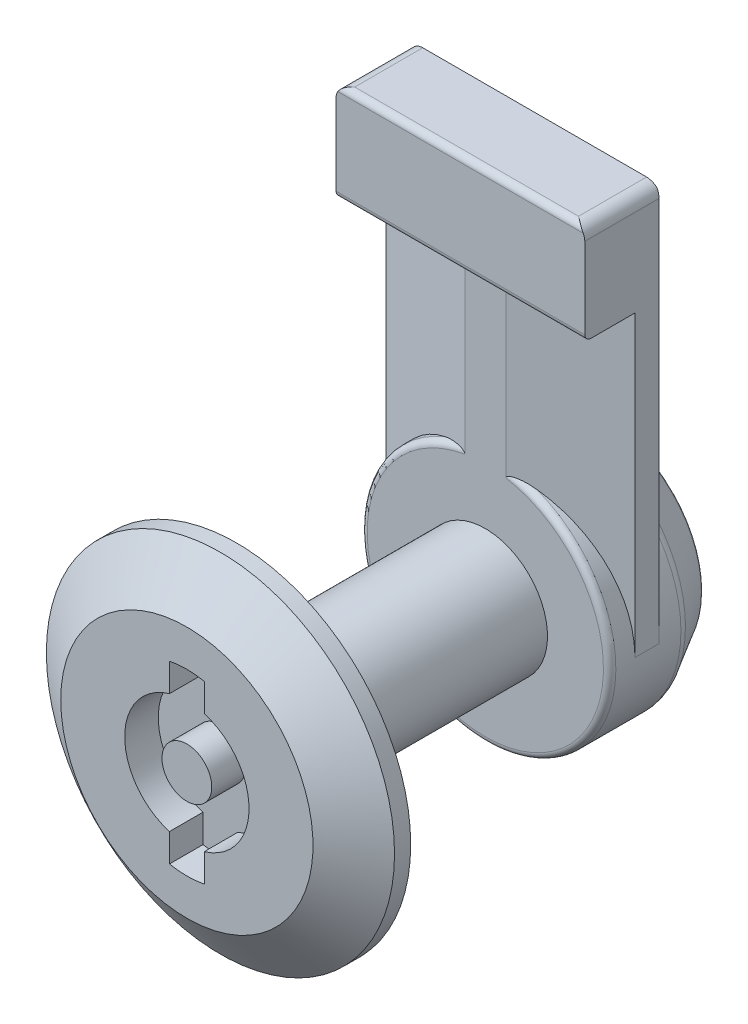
ISO-10303-21;
HEADER;
FILE_DESCRIPTION(('STEP AP214'),'2;1');
FILE_NAME('part.step','',(''),(''),'','','');
FILE_SCHEMA(('AUTOMOTIVE_DESIGN { 1 0 10303 214 1 1 1 1 }'));
ENDSEC;
DATA;
#1=APPLICATION_CONTEXT('core data for automotive mechanical design processes');
#2=APPLICATION_PROTOCOL_DEFINITION('international standard','automotive_design',2000,#1);
#3=PRODUCT_CONTEXT('',#1,'mechanical');
#4=PRODUCT('Part','Part','',(#3));
#5=PRODUCT_RELATED_PRODUCT_CATEGORY('part','',(#4));
#6=PRODUCT_DEFINITION_FORMATION('','',#4);
#7=PRODUCT_DEFINITION_CONTEXT('part definition',#1,'design');
#8=PRODUCT_DEFINITION('design','',#6,#7);
#9=PRODUCT_DEFINITION_SHAPE('','',#8);
#10=(LENGTH_UNIT() NAMED_UNIT(*) SI_UNIT(.MILLI.,.METRE.));
#11=(NAMED_UNIT(*) PLANE_ANGLE_UNIT() SI_UNIT($,.RADIAN.));
#12=(NAMED_UNIT(*) SI_UNIT($,.STERADIAN.) SOLID_ANGLE_UNIT());
#13=UNCERTAINTY_MEASURE_WITH_UNIT(LENGTH_MEASURE(1.E-05),#10,'distance_accuracy_value','');
#14=(GEOMETRIC_REPRESENTATION_CONTEXT(3) GLOBAL_UNCERTAINTY_ASSIGNED_CONTEXT((#13)) GLOBAL_UNIT_ASSIGNED_CONTEXT((#10,
#11,#12)) REPRESENTATION_CONTEXT('',''));
#15=CARTESIAN_POINT('',(0.,0.,0.));
#16=DIRECTION('',(0.,0.,1.));
#17=DIRECTION('',(1.,0.,0.));
#18=AXIS2_PLACEMENT_3D('',#15,#16,#17);
#19=CARTESIAN_POINT('',(0.,10.1440003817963,4.));
#20=DIRECTION('',(0.,0.,-1.));
#21=DIRECTION('',(-1.,0.,0.));
#22=AXIS2_PLACEMENT_3D('',#19,#20,#21);
#23=PLANE('',#22);
#24=CARTESIAN_POINT('',(0.,0.,4.));
#25=DIRECTION('',(0.,0.,-1.));
#26=DIRECTION('',(-1.,0.,0.));
#27=AXIS2_PLACEMENT_3D('',#24,#25,#26);
#28=CIRCLE('',#27,2.);
#29=CARTESIAN_POINT('',(-2.,0.,4.));
#30=VERTEX_POINT('',#29);
#31=EDGE_CURVE('E17',#30,#30,#28,.T.);
#32=ORIENTED_EDGE('',*,*,#31,.F.);
#33=EDGE_LOOP('',(#32));
#34=FACE_BOUND('',#33,.T.);
#35=ADVANCED_FACE('F14',(#34),#23,.F.);
#36=CARTESIAN_POINT('',(0.,0.,1.3));
#37=DIRECTION('',(0.,0.,-1.));
#38=DIRECTION('',(-1.,0.,0.));
#39=AXIS2_PLACEMENT_3D('',#36,#37,#38);
#40=CYLINDRICAL_SURFACE('',#39,2.);
#41=ORIENTED_EDGE('',*,*,#31,.T.);
#42=EDGE_LOOP('',(#41));
#43=FACE_BOUND('',#42,.T.);
#44=CARTESIAN_POINT('',(0.,0.,1.3));
#45=DIRECTION('',(0.,0.,-1.));
#46=DIRECTION('',(-1.,0.,0.));
#47=AXIS2_PLACEMENT_3D('',#44,#45,#46);
#48=CIRCLE('',#47,2.);
#49=CARTESIAN_POINT('',(-2.,0.,1.3));
#50=VERTEX_POINT('',#49);
#51=EDGE_CURVE('E485',#50,#50,#48,.T.);
#52=ORIENTED_EDGE('',*,*,#51,.F.);
#53=EDGE_LOOP('',(#52));
#54=FACE_BOUND('',#53,.T.);
#55=ADVANCED_FACE('F493',(#43,#54),#40,.T.);
#56=CARTESIAN_POINT('',(0.,0.,-29.5));
#57=DIRECTION('',(0.,0.,1.));
#58=DIRECTION('',(1.,0.,0.));
#59=AXIS2_PLACEMENT_3D('',#56,#57,#58);
#60=PLANE('',#59);
#61=CARTESIAN_POINT('',(0.,0.,-29.5));
#62=DIRECTION('',(0.,0.,1.));
#63=DIRECTION('',(1.,0.,0.));
#64=AXIS2_PLACEMENT_3D('',#61,#62,#63);
#65=CIRCLE('',#64,7.6905989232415);
#66=CARTESIAN_POINT('',(7.6905989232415,0.,-29.5));
#67=VERTEX_POINT('',#66);
#68=EDGE_CURVE('E198',#67,#67,#65,.T.);
#69=ORIENTED_EDGE('',*,*,#68,.F.);
#70=EDGE_LOOP('',(#69));
#71=FACE_BOUND('',#70,.T.);
#72=ADVANCED_FACE('F501',(#71),#60,.F.);
#73=CARTESIAN_POINT('',(0.,0.,1.3));
#74=DIRECTION('',(0.,0.,1.));
#75=DIRECTION('',(1.,0.,0.));
#76=AXIS2_PLACEMENT_3D('',#73,#74,#75);
#77=PLANE('',#76);
#78=DIRECTION('',(0.,1.,0.));
#79=VECTOR('',#78,1.);
#80=CARTESIAN_POINT('',(1.4,4.8,1.3));
#81=LINE('',#80,#79);
#82=CARTESIAN_POINT('',(1.4,4.8,1.3));
#83=VERTEX_POINT('',#82);
#84=CARTESIAN_POINT('',(1.4,7.06257743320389,1.3));
#85=VERTEX_POINT('',#84);
#86=EDGE_CURVE('E471',#83,#85,#81,.T.);
#87=ORIENTED_EDGE('',*,*,#86,.T.);
#88=CARTESIAN_POINT('',(0.,0.,1.3));
#89=DIRECTION('',(0.,0.,-1.));
#90=DIRECTION('',(-1.,0.,0.));
#91=AXIS2_PLACEMENT_3D('',#88,#89,#90);
#92=CIRCLE('',#91,7.2);
#93=CARTESIAN_POINT('',(-1.4,7.06257743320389,1.3));
#94=VERTEX_POINT('',#93);
#95=EDGE_CURVE('E468',#85,#94,#92,.F.);
#96=ORIENTED_EDGE('',*,*,#95,.T.);
#97=DIRECTION('',(0.,1.,0.));
#98=VECTOR('',#97,1.);
#99=CARTESIAN_POINT('',(-1.4,7.06257743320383,1.3));
#100=LINE('',#99,#98);
#101=CARTESIAN_POINT('',(-1.4,4.8,1.3));
#102=VERTEX_POINT('',#101);
#103=EDGE_CURVE('E484',#94,#102,#100,.F.);
#104=ORIENTED_EDGE('',*,*,#103,.T.);
#105=CARTESIAN_POINT('',(0.,0.,1.3));
#106=DIRECTION('',(0.,0.,-1.));
#107=DIRECTION('',(-1.,0.,0.));
#108=AXIS2_PLACEMENT_3D('',#105,#106,#107);
#109=CIRCLE('',#108,5.);
#110=CARTESIAN_POINT('',(-1.4,-4.8,1.3));
#111=VERTEX_POINT('',#110);
#112=EDGE_CURVE('E480',#102,#111,#109,.F.);
#113=ORIENTED_EDGE('',*,*,#112,.T.);
#114=DIRECTION('',(0.,1.,0.));
#115=VECTOR('',#114,1.);
#116=CARTESIAN_POINT('',(-1.4,-4.8,1.3));
#117=LINE('',#116,#115);
#118=CARTESIAN_POINT('',(-1.4,-7.06257743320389,1.3));
#119=VERTEX_POINT('',#118);
#120=EDGE_CURVE('E548',#111,#119,#117,.F.);
#121=ORIENTED_EDGE('',*,*,#120,.T.);
#122=CARTESIAN_POINT('',(0.,0.,1.3));
#123=DIRECTION('',(0.,0.,-1.));
#124=DIRECTION('',(-1.,0.,0.));
#125=AXIS2_PLACEMENT_3D('',#122,#123,#124);
#126=CIRCLE('',#125,7.2);
#127=CARTESIAN_POINT('',(1.4,-7.06257743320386,1.3));
#128=VERTEX_POINT('',#127);
#129=EDGE_CURVE('E476',#119,#128,#126,.F.);
#130=ORIENTED_EDGE('',*,*,#129,.T.);
#131=DIRECTION('',(0.,1.,0.));
#132=VECTOR('',#131,1.);
#133=CARTESIAN_POINT('',(1.4,-7.06257743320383,1.3));
#134=LINE('',#133,#132);
#135=CARTESIAN_POINT('',(1.4,-4.8,1.3));
#136=VERTEX_POINT('',#135);
#137=EDGE_CURVE('E547',#128,#136,#134,.T.);
#138=ORIENTED_EDGE('',*,*,#137,.T.);
#139=CARTESIAN_POINT('',(0.,0.,1.3));
#140=DIRECTION('',(0.,0.,-1.));
#141=DIRECTION('',(-1.,0.,0.));
#142=AXIS2_PLACEMENT_3D('',#139,#140,#141);
#143=CIRCLE('',#142,5.);
#144=EDGE_CURVE('E472',#136,#83,#143,.F.);
#145=ORIENTED_EDGE('',*,*,#144,.T.);
#146=EDGE_LOOP('',(#87,#96,#104,#113,#121,#130,#138,#145));
#147=FACE_BOUND('',#146,.T.);
#148=ORIENTED_EDGE('',*,*,#51,.T.);
#149=EDGE_LOOP('',(#148));
#150=FACE_BOUND('',#149,.T.);
#151=ADVANCED_FACE('F506',(#147,#150),#77,.T.);
#152=CARTESIAN_POINT('',(0.,0.,-29.));
#153=DIRECTION('',(0.,0.,1.));
#154=DIRECTION('',(1.,0.,0.));
#155=AXIS2_PLACEMENT_3D('',#152,#153,#154);
#156=TOROIDAL_SURFACE('',#155,7.6905989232,0.5);
#157=CARTESIAN_POINT('',(0.,0.,-29.2499999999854));
#158=DIRECTION('',(0.,0.,1.));
#159=DIRECTION('',(1.,0.,0.));
#160=AXIS2_PLACEMENT_3D('',#157,#158,#159);
#161=CIRCLE('',#160,8.12361162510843);
#162=CARTESIAN_POINT('',(8.12361162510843,0.,-29.2499999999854));
#163=VERTEX_POINT('',#162);
#164=EDGE_CURVE('E467',#163,#163,#161,.T.);
#165=ORIENTED_EDGE('',*,*,#164,.F.);
#166=EDGE_LOOP('',(#165));
#167=FACE_BOUND('',#166,.T.);
#168=ORIENTED_EDGE('',*,*,#68,.T.);
#169=EDGE_LOOP('',(#168));
#170=FACE_BOUND('',#169,.T.);
#171=ADVANCED_FACE('F529',(#167,#170),#156,.T.);
#172=CARTESIAN_POINT('',(-10.,32.,-23.97));
#173=DIRECTION('',(0.,0.,1.));
#174=DIRECTION('',(1.,0.,0.));
#175=AXIS2_PLACEMENT_3D('',#172,#173,#174);
#176=PLANE('',#175);
#177=DIRECTION('',(-1.,0.,0.));
#178=VECTOR('',#177,1.);
#179=CARTESIAN_POINT('',(0.,32.,-23.97));
#180=LINE('',#179,#178);
#181=CARTESIAN_POINT('',(9.,32.,-23.97));
#182=VERTEX_POINT('',#181);
#183=CARTESIAN_POINT('',(-9.,32.,-23.97));
#184=VERTEX_POINT('',#183);
#185=EDGE_CURVE('E201',#182,#184,#180,.T.);
#186=ORIENTED_EDGE('',*,*,#185,.F.);
#187=CARTESIAN_POINT('',(9.,31.,-23.97));
#188=DIRECTION('',(0.,0.,-1.));
#189=DIRECTION('',(-1.,0.,0.));
#190=AXIS2_PLACEMENT_3D('',#187,#188,#189);
#191=CIRCLE('',#190,1.);
#192=CARTESIAN_POINT('',(9.33791544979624,31.9411764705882,-23.97));
#193=VERTEX_POINT('',#192);
#194=EDGE_CURVE('E186',#193,#182,#191,.F.);
#195=ORIENTED_EDGE('',*,*,#194,.F.);
#196=DIRECTION('',(-1.,0.,0.));
#197=VECTOR('',#196,1.);
#198=CARTESIAN_POINT('',(-20.,31.9411764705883,-23.97));
#199=LINE('',#198,#197);
#200=CARTESIAN_POINT('',(-9.33791544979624,31.9411764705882,-23.97));
#201=VERTEX_POINT('',#200);
#202=EDGE_CURVE('E466',#201,#193,#199,.F.);
#203=ORIENTED_EDGE('',*,*,#202,.F.);
#204=CARTESIAN_POINT('',(-9.,31.,-23.97));
#205=DIRECTION('',(0.,0.,-1.));
#206=DIRECTION('',(-1.,0.,0.));
#207=AXIS2_PLACEMENT_3D('',#204,#205,#206);
#208=CIRCLE('',#207,1.);
#209=EDGE_CURVE('E197',#184,#201,#208,.F.);
#210=ORIENTED_EDGE('',*,*,#209,.F.);
#211=EDGE_LOOP('',(#186,#195,#203,#210));
#212=FACE_BOUND('',#211,.T.);
#213=ADVANCED_FACE('F202',(#212),#176,.F.);
#214=CARTESIAN_POINT('',(-1.4,7.06257743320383,1.3));
#215=DIRECTION('',(-1.,0.,0.));
#216=DIRECTION('',(0.,0.,1.));
#217=AXIS2_PLACEMENT_3D('',#214,#215,#216);
#218=PLANE('',#217);
#219=DIRECTION('',(0.,0.,-1.));
#220=VECTOR('',#219,1.);
#221=CARTESIAN_POINT('',(-1.4,4.8,1.3));
#222=LINE('',#221,#220);
#223=CARTESIAN_POINT('',(-1.4,4.8,4.));
#224=VERTEX_POINT('',#223);
#225=EDGE_CURVE('E483',#224,#102,#222,.T.);
#226=ORIENTED_EDGE('',*,*,#225,.T.);
#227=ORIENTED_EDGE('',*,*,#103,.F.);
#228=DIRECTION('',(0.,0.,-1.));
#229=VECTOR('',#228,1.);
#230=CARTESIAN_POINT('',(-1.40000000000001,7.06257743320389,1.3));
#231=LINE('',#230,#229);
#232=CARTESIAN_POINT('',(-1.4,7.06257743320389,4.));
#233=VERTEX_POINT('',#232);
#234=EDGE_CURVE('E470',#94,#233,#231,.F.);
#235=ORIENTED_EDGE('',*,*,#234,.T.);
#236=DIRECTION('',(0.,1.,0.));
#237=VECTOR('',#236,1.);
#238=CARTESIAN_POINT('',(-1.4,10.1440003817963,4.));
#239=LINE('',#238,#237);
#240=EDGE_CURVE('E462',#233,#224,#239,.F.);
#241=ORIENTED_EDGE('',*,*,#240,.T.);
#242=EDGE_LOOP('',(#226,#227,#235,#241));
#243=FACE_BOUND('',#242,.T.);
#244=ADVANCED_FACE('F600',(#243),#218,.F.);
#245=CARTESIAN_POINT('',(0.,0.,1.3));
#246=DIRECTION('',(0.,0.,-1.));
#247=DIRECTION('',(-1.,0.,0.));
#248=AXIS2_PLACEMENT_3D('',#245,#246,#247);
#249=CYLINDRICAL_SURFACE('',#248,5.);
#250=DIRECTION('',(0.,0.,1.));
#251=VECTOR('',#250,1.);
#252=CARTESIAN_POINT('',(-1.4,-4.8,1.3));
#253=LINE('',#252,#251);
#254=CARTESIAN_POINT('',(-1.4,-4.8,4.));
#255=VERTEX_POINT('',#254);
#256=EDGE_CURVE('E482',#255,#111,#253,.F.);
#257=ORIENTED_EDGE('',*,*,#256,.T.);
#258=ORIENTED_EDGE('',*,*,#112,.F.);
#259=ORIENTED_EDGE('',*,*,#225,.F.);
#260=CARTESIAN_POINT('',(0.,0.,4.));
#261=DIRECTION('',(0.,0.,-1.));
#262=DIRECTION('',(-1.,0.,0.));
#263=AXIS2_PLACEMENT_3D('',#260,#261,#262);
#264=CIRCLE('',#263,5.);
#265=EDGE_CURVE('E460',#224,#255,#264,.F.);
#266=ORIENTED_EDGE('',*,*,#265,.T.);
#267=EDGE_LOOP('',(#257,#258,#259,#266));
#268=FACE_BOUND('',#267,.T.);
#269=ADVANCED_FACE('F602',(#268),#249,.F.);
#270=CARTESIAN_POINT('',(-1.4,-4.8,1.3));
#271=DIRECTION('',(-1.,0.,0.));
#272=DIRECTION('',(0.,0.,1.));
#273=AXIS2_PLACEMENT_3D('',#270,#271,#272);
#274=PLANE('',#273);
#275=DIRECTION('',(0.,0.,-1.));
#276=VECTOR('',#275,1.);
#277=CARTESIAN_POINT('',(-1.40000000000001,-7.06257743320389,1.3));
#278=LINE('',#277,#276);
#279=CARTESIAN_POINT('',(-1.4,-7.06257743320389,4.));
#280=VERTEX_POINT('',#279);
#281=EDGE_CURVE('E479',#280,#119,#278,.T.);
#282=ORIENTED_EDGE('',*,*,#281,.T.);
#283=ORIENTED_EDGE('',*,*,#120,.F.);
#284=ORIENTED_EDGE('',*,*,#256,.F.);
#285=DIRECTION('',(0.,1.,0.));
#286=VECTOR('',#285,1.);
#287=CARTESIAN_POINT('',(-1.4,10.1440003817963,4.));
#288=LINE('',#287,#286);
#289=EDGE_CURVE('E459',#255,#280,#288,.F.);
#290=ORIENTED_EDGE('',*,*,#289,.T.);
#291=EDGE_LOOP('',(#282,#283,#284,#290));
#292=FACE_BOUND('',#291,.T.);
#293=ADVANCED_FACE('F618',(#292),#274,.F.);
#294=CARTESIAN_POINT('',(0.,0.,1.3));
#295=DIRECTION('',(0.,0.,-1.));
#296=DIRECTION('',(-1.,0.,0.));
#297=AXIS2_PLACEMENT_3D('',#294,#295,#296);
#298=CYLINDRICAL_SURFACE('',#297,7.2);
#299=DIRECTION('',(0.,0.,-1.));
#300=VECTOR('',#299,1.);
#301=CARTESIAN_POINT('',(1.4,-7.06257743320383,1.3));
#302=LINE('',#301,#300);
#303=CARTESIAN_POINT('',(1.4,-7.06257743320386,4.));
#304=VERTEX_POINT('',#303);
#305=EDGE_CURVE('E478',#304,#128,#302,.T.);
#306=ORIENTED_EDGE('',*,*,#305,.T.);
#307=ORIENTED_EDGE('',*,*,#129,.F.);
#308=ORIENTED_EDGE('',*,*,#281,.F.);
#309=CARTESIAN_POINT('',(0.,0.,4.));
#310=DIRECTION('',(0.,0.,-1.));
#311=DIRECTION('',(-1.,0.,0.));
#312=AXIS2_PLACEMENT_3D('',#309,#310,#311);
#313=CIRCLE('',#312,7.2);
#314=EDGE_CURVE('E457',#280,#304,#313,.F.);
#315=ORIENTED_EDGE('',*,*,#314,.T.);
#316=EDGE_LOOP('',(#306,#307,#308,#315));
#317=FACE_BOUND('',#316,.T.);
#318=ADVANCED_FACE('F615',(#317),#298,.F.);
#319=CARTESIAN_POINT('',(1.4,-7.06257743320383,1.3));
#320=DIRECTION('',(1.,0.,0.));
#321=DIRECTION('',(0.,0.,-1.));
#322=AXIS2_PLACEMENT_3D('',#319,#320,#321);
#323=PLANE('',#322);
#324=DIRECTION('',(0.,0.,-1.));
#325=VECTOR('',#324,1.);
#326=CARTESIAN_POINT('',(1.4,-4.8,1.3));
#327=LINE('',#326,#325);
#328=CARTESIAN_POINT('',(1.4,-4.8,4.));
#329=VERTEX_POINT('',#328);
#330=EDGE_CURVE('E475',#329,#136,#327,.T.);
#331=ORIENTED_EDGE('',*,*,#330,.T.);
#332=ORIENTED_EDGE('',*,*,#137,.F.);
#333=ORIENTED_EDGE('',*,*,#305,.F.);
#334=DIRECTION('',(0.,1.,0.));
#335=VECTOR('',#334,1.);
#336=CARTESIAN_POINT('',(1.4,10.1440003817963,4.));
#337=LINE('',#336,#335);
#338=EDGE_CURVE('E456',#304,#329,#337,.T.);
#339=ORIENTED_EDGE('',*,*,#338,.T.);
#340=EDGE_LOOP('',(#331,#332,#333,#339));
#341=FACE_BOUND('',#340,.T.);
#342=ADVANCED_FACE('F612',(#341),#323,.F.);
#343=CARTESIAN_POINT('',(0.,0.,1.3));
#344=DIRECTION('',(0.,0.,-1.));
#345=DIRECTION('',(-1.,0.,0.));
#346=AXIS2_PLACEMENT_3D('',#343,#344,#345);
#347=CYLINDRICAL_SURFACE('',#346,5.);
#348=DIRECTION('',(0.,0.,-1.));
#349=VECTOR('',#348,1.);
#350=CARTESIAN_POINT('',(1.4,4.8,1.3));
#351=LINE('',#350,#349);
#352=CARTESIAN_POINT('',(1.4,4.8,4.));
#353=VERTEX_POINT('',#352);
#354=EDGE_CURVE('E474',#353,#83,#351,.T.);
#355=ORIENTED_EDGE('',*,*,#354,.T.);
#356=ORIENTED_EDGE('',*,*,#144,.F.);
#357=ORIENTED_EDGE('',*,*,#330,.F.);
#358=CARTESIAN_POINT('',(0.,0.,4.));
#359=DIRECTION('',(0.,0.,-1.));
#360=DIRECTION('',(-1.,0.,0.));
#361=AXIS2_PLACEMENT_3D('',#358,#359,#360);
#362=CIRCLE('',#361,5.);
#363=EDGE_CURVE('E454',#329,#353,#362,.F.);
#364=ORIENTED_EDGE('',*,*,#363,.T.);
#365=EDGE_LOOP('',(#355,#356,#357,#364));
#366=FACE_BOUND('',#365,.T.);
#367=ADVANCED_FACE('F607',(#366),#347,.F.);
#368=CARTESIAN_POINT('',(1.4,4.8,1.3));
#369=DIRECTION('',(1.,0.,0.));
#370=DIRECTION('',(0.,0.,-1.));
#371=AXIS2_PLACEMENT_3D('',#368,#369,#370);
#372=PLANE('',#371);
#373=DIRECTION('',(0.,0.,-1.));
#374=VECTOR('',#373,1.);
#375=CARTESIAN_POINT('',(1.4,7.06257743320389,1.3));
#376=LINE('',#375,#374);
#377=CARTESIAN_POINT('',(1.4,7.06257743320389,4.));
#378=VERTEX_POINT('',#377);
#379=EDGE_CURVE('E564',#378,#85,#376,.T.);
#380=ORIENTED_EDGE('',*,*,#379,.T.);
#381=ORIENTED_EDGE('',*,*,#86,.F.);
#382=ORIENTED_EDGE('',*,*,#354,.F.);
#383=DIRECTION('',(0.,1.,0.));
#384=VECTOR('',#383,1.);
#385=CARTESIAN_POINT('',(1.4,10.1440003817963,4.));
#386=LINE('',#385,#384);
#387=EDGE_CURVE('E453',#353,#378,#386,.T.);
#388=ORIENTED_EDGE('',*,*,#387,.T.);
#389=EDGE_LOOP('',(#380,#381,#382,#388));
#390=FACE_BOUND('',#389,.T.);
#391=ADVANCED_FACE('F585',(#390),#372,.F.);
#392=CARTESIAN_POINT('',(0.,0.,1.3));
#393=DIRECTION('',(0.,0.,-1.));
#394=DIRECTION('',(-1.,0.,0.));
#395=AXIS2_PLACEMENT_3D('',#392,#393,#394);
#396=CYLINDRICAL_SURFACE('',#395,7.2);
#397=CARTESIAN_POINT('',(0.,0.,4.));
#398=DIRECTION('',(0.,0.,-1.));
#399=DIRECTION('',(-1.,0.,0.));
#400=AXIS2_PLACEMENT_3D('',#397,#398,#399);
#401=CIRCLE('',#400,7.2);
#402=EDGE_CURVE('E449',#378,#233,#401,.F.);
#403=ORIENTED_EDGE('',*,*,#402,.T.);
#404=ORIENTED_EDGE('',*,*,#234,.F.);
#405=ORIENTED_EDGE('',*,*,#95,.F.);
#406=ORIENTED_EDGE('',*,*,#379,.F.);
#407=EDGE_LOOP('',(#403,#404,#405,#406));
#408=FACE_BOUND('',#407,.T.);
#409=ADVANCED_FACE('F592',(#408),#396,.F.);
#410=CARTESIAN_POINT('',(0.,0.,-26.2320508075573));
#411=DIRECTION('',(0.,0.,1.));
#412=DIRECTION('',(1.,0.,0.));
#413=AXIS2_PLACEMENT_3D('',#410,#411,#412);
#414=CONICAL_SURFACE('',#413,9.86602540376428,0.523598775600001);
#415=ORIENTED_EDGE('',*,*,#164,.T.);
#416=EDGE_LOOP('',(#415));
#417=FACE_BOUND('',#416,.T.);
#418=CARTESIAN_POINT('',(0.,0.,-26.2320508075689));
#419=DIRECTION('',(0.,0.,1.));
#420=DIRECTION('',(1.,0.,0.));
#421=AXIS2_PLACEMENT_3D('',#418,#419,#420);
#422=CIRCLE('',#421,9.86602540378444);
#423=CARTESIAN_POINT('',(9.86602540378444,0.,-26.2320508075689));
#424=VERTEX_POINT('',#423);
#425=EDGE_CURVE('E223',#424,#424,#422,.T.);
#426=ORIENTED_EDGE('',*,*,#425,.F.);
#427=EDGE_LOOP('',(#426));
#428=FACE_BOUND('',#427,.T.);
#429=ADVANCED_FACE('F748',(#417,#428),#414,.T.);
#430=CARTESIAN_POINT('',(1.65,32.,-26.));
#431=DIRECTION('',(0.,0.,1.));
#432=DIRECTION('',(1.,0.,0.));
#433=AXIS2_PLACEMENT_3D('',#430,#431,#432);
#434=PLANE('',#433);
#435=DIRECTION('',(0.,1.,0.));
#436=VECTOR('',#435,1.);
#437=CARTESIAN_POINT('',(1.65,32.,-26.));
#438=LINE('',#437,#436);
#439=CARTESIAN_POINT('',(1.65,20.,-26.));
#440=VERTEX_POINT('',#439);
#441=CARTESIAN_POINT('',(1.65,9.82585864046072,-26.));
#442=VERTEX_POINT('',#441);
#443=EDGE_CURVE('E426',#440,#442,#438,.F.);
#444=ORIENTED_EDGE('',*,*,#443,.T.);
#445=CARTESIAN_POINT('',(0.,0.,-26.));
#446=DIRECTION('',(0.,0.,1.));
#447=DIRECTION('',(1.,0.,0.));
#448=AXIS2_PLACEMENT_3D('',#445,#446,#447);
#449=CIRCLE('',#448,9.96343304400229);
#450=CARTESIAN_POINT('',(-1.65,9.82585864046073,-26.));
#451=VERTEX_POINT('',#450);
#452=EDGE_CURVE('E215',#451,#442,#449,.F.);
#453=ORIENTED_EDGE('',*,*,#452,.F.);
#454=DIRECTION('',(0.,1.,0.));
#455=VECTOR('',#454,1.);
#456=CARTESIAN_POINT('',(-1.65,32.,-26.));
#457=LINE('',#456,#455);
#458=CARTESIAN_POINT('',(-1.65,20.,-26.));
#459=VERTEX_POINT('',#458);
#460=EDGE_CURVE('E253',#451,#459,#457,.T.);
#461=ORIENTED_EDGE('',*,*,#460,.T.);
#462=DIRECTION('',(-1.,0.,0.));
#463=VECTOR('',#462,1.);
#464=CARTESIAN_POINT('',(-20.,20.,-26.));
#465=LINE('',#464,#463);
#466=EDGE_CURVE('E207',#440,#459,#465,.T.);
#467=ORIENTED_EDGE('',*,*,#466,.F.);
#468=EDGE_LOOP('',(#444,#453,#461,#467));
#469=FACE_BOUND('',#468,.T.);
#470=ADVANCED_FACE('F443',(#469),#434,.F.);
#471=CARTESIAN_POINT('',(-20.,20.,-26.));
#472=DIRECTION('',(0.,0.167595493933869,-0.985855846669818));
#473=DIRECTION('',(0.,-0.985855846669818,-0.167595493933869));
#474=AXIS2_PLACEMENT_3D('',#471,#472,#473);
#475=PLANE('',#474);
#476=DIRECTION('',(-0.567574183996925,-0.811677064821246,-0.137985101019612));
#477=VECTOR('',#476,1.);
#478=CARTESIAN_POINT('',(9.77970883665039,31.6261422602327,-24.0235558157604));
#479=LINE('',#478,#477);
#480=CARTESIAN_POINT('',(9.77970883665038,31.6261422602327,-24.0235558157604));
#481=VERTEX_POINT('',#480);
#482=EDGE_CURVE('E213',#481,#440,#479,.T.);
#483=ORIENTED_EDGE('',*,*,#482,.T.);
#484=ORIENTED_EDGE('',*,*,#466,.T.);
#485=DIRECTION('',(-0.567574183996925,0.811677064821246,0.137985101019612));
#486=VECTOR('',#485,1.);
#487=CARTESIAN_POINT('',(-1.65,20.,-26.));
#488=LINE('',#487,#486);
#489=CARTESIAN_POINT('',(-9.77970883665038,31.6261422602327,-24.0235558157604));
#490=VERTEX_POINT('',#489);
#491=EDGE_CURVE('E415',#459,#490,#488,.T.);
#492=ORIENTED_EDGE('',*,*,#491,.T.);
#493=CARTESIAN_POINT('',(-9.,31.,-24.13));
#494=DIRECTION('',(0.,0.167595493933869,-0.985855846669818));
#495=DIRECTION('',(0.,-0.985855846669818,-0.167595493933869));
#496=AXIS2_PLACEMENT_3D('',#493,#494,#495);
#497=ELLIPSE('',#496,1.01434708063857,1.);
#498=EDGE_CURVE('E463',#490,#201,#497,.T.);
#499=ORIENTED_EDGE('',*,*,#498,.T.);
#500=ORIENTED_EDGE('',*,*,#202,.T.);
#501=CARTESIAN_POINT('',(9.,31.,-24.13));
#502=DIRECTION('',(0.,0.167595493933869,-0.985855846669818));
#503=DIRECTION('',(0.,-0.985855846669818,-0.167595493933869));
#504=AXIS2_PLACEMENT_3D('',#501,#502,#503);
#505=ELLIPSE('',#504,1.01434708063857,1.);
#506=EDGE_CURVE('E196',#481,#193,#505,.F.);
#507=ORIENTED_EDGE('',*,*,#506,.F.);
#508=EDGE_LOOP('',(#483,#484,#492,#499,#500,#507));
#509=FACE_BOUND('',#508,.T.);
#510=ADVANCED_FACE('F436',(#509),#475,.T.);
#511=CARTESIAN_POINT('',(0.,32.,0.));
#512=DIRECTION('',(0.,1.,0.));
#513=DIRECTION('',(-1.,0.,0.));
#514=AXIS2_PLACEMENT_3D('',#511,#512,#513);
#515=PLANE('',#514);
#516=DIRECTION('',(-1.,0.,0.));
#517=VECTOR('',#516,1.);
#518=CARTESIAN_POINT('',(-10.,32.,-18.5));
#519=LINE('',#518,#517);
#520=CARTESIAN_POINT('',(9.,32.,-18.5));
#521=VERTEX_POINT('',#520);
#522=CARTESIAN_POINT('',(-9.,32.,-18.5));
#523=VERTEX_POINT('',#522);
#524=EDGE_CURVE('E206',#521,#523,#519,.T.);
#525=ORIENTED_EDGE('',*,*,#524,.F.);
#526=DIRECTION('',(0.,0.,-1.));
#527=VECTOR('',#526,1.);
#528=CARTESIAN_POINT('',(9.,32.,-61.5));
#529=LINE('',#528,#527);
#530=EDGE_CURVE('E194',#182,#521,#529,.F.);
#531=ORIENTED_EDGE('',*,*,#530,.F.);
#532=ORIENTED_EDGE('',*,*,#185,.T.);
#533=DIRECTION('',(0.,0.,-1.));
#534=VECTOR('',#533,1.);
#535=CARTESIAN_POINT('',(-9.,32.,-61.5));
#536=LINE('',#535,#534);
#537=EDGE_CURVE('E410',#523,#184,#536,.T.);
#538=ORIENTED_EDGE('',*,*,#537,.F.);
#539=EDGE_LOOP('',(#525,#531,#532,#538));
#540=FACE_BOUND('',#539,.T.);
#541=ADVANCED_FACE('F209',(#540),#515,.T.);
#542=CARTESIAN_POINT('',(-10.,31.5,-18.5));
#543=DIRECTION('',(-1.,0.,0.));
#544=DIRECTION('',(0.,0.,1.));
#545=AXIS2_PLACEMENT_3D('',#542,#543,#544);
#546=CYLINDRICAL_SURFACE('',#545,0.5);
#547=CARTESIAN_POINT('',(9.86602540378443,31.5,-18.));
#548=CARTESIAN_POINT('',(9.8552155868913,31.5187331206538,-18.0000007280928));
#549=CARTESIAN_POINT('',(9.84380559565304,31.5370821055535,-18.0010520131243));
#550=CARTESIAN_POINT('',(9.8199559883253,31.5728266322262,-18.0050063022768));
#551=CARTESIAN_POINT('',(9.80751905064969,31.5902244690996,-18.0079046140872));
#552=CARTESIAN_POINT('',(9.76919300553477,31.6403867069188,-18.0189042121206));
#553=CARTESIAN_POINT('',(9.74198170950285,31.671644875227,-18.0293243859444));
#554=CARTESIAN_POINT('',(9.67964579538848,31.7351378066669,-18.0571299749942));
#555=CARTESIAN_POINT('',(9.6440014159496,31.7664232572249,-18.0754643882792));
#556=CARTESIAN_POINT('',(9.57019040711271,31.8228339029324,-18.1165900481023));
#557=CARTESIAN_POINT('',(9.53200980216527,31.847920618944,-18.1394076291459));
#558=CARTESIAN_POINT('',(9.43829640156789,31.901032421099,-18.1978345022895));
#559=CARTESIAN_POINT('',(9.38200320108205,31.92612673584,-18.2348798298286));
#560=CARTESIAN_POINT('',(9.26794938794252,31.9653175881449,-18.3119899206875));
#561=CARTESIAN_POINT('',(9.2101907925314,31.9794284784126,-18.3520506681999));
#562=CARTESIAN_POINT('',(9.10326581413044,31.9958777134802,-18.4269901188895));
#563=CARTESIAN_POINT('',(9.05419676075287,31.9997336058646,-18.4616774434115));
#564=CARTESIAN_POINT('',(9.00344260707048,31.9999955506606,-18.4975657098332));
#565=CARTESIAN_POINT('',(9.00172127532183,31.9999999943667,-18.4987828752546));
#566=CARTESIAN_POINT('',(9.,32.,-18.5));
#567=B_SPLINE_CURVE_WITH_KNOTS('',3,(#547,#548,#549,#550,#551,#552,#553,#554,#555,#556,#557,
#558,#559,#560,#561,#562,#563,#564,#565,#566),.UNSPECIFIED.,.F.,.F.,(4,2,2,2,2,2,2,2,2,4),(0.,
0.0647962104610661,0.129428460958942,0.256901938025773,0.408670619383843,0.561358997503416,
0.775938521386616,0.99023716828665,1.17039020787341,1.17671477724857),.UNSPECIFIED.);
#568=CARTESIAN_POINT('',(9.86602540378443,31.5,-18.));
#569=VERTEX_POINT('',#568);
#570=EDGE_CURVE('E211',#521,#569,#567,.F.);
#571=ORIENTED_EDGE('',*,*,#570,.F.);
#572=ORIENTED_EDGE('',*,*,#524,.T.);
#573=CARTESIAN_POINT('',(-9.86602540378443,31.5,-18.));
#574=CARTESIAN_POINT('',(-9.8552155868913,31.5187331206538,-18.0000007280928));
#575=CARTESIAN_POINT('',(-9.84380559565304,31.5370821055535,-18.0010520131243));
#576=CARTESIAN_POINT('',(-9.8199559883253,31.5728266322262,-18.0050063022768));
#577=CARTESIAN_POINT('',(-9.80751905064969,31.5902244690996,-18.0079046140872));
#578=CARTESIAN_POINT('',(-9.76919300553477,31.6403867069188,-18.0189042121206));
#579=CARTESIAN_POINT('',(-9.74198170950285,31.671644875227,-18.0293243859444));
#580=CARTESIAN_POINT('',(-9.67964579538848,31.7351378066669,-18.0571299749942));
#581=CARTESIAN_POINT('',(-9.6440014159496,31.7664232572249,-18.0754643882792));
#582=CARTESIAN_POINT('',(-9.57019040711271,31.8228339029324,-18.1165900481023));
#583=CARTESIAN_POINT('',(-9.53200980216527,31.847920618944,-18.1394076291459));
#584=CARTESIAN_POINT('',(-9.43829640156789,31.901032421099,-18.1978345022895));
#585=CARTESIAN_POINT('',(-9.38200320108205,31.92612673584,-18.2348798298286));
#586=CARTESIAN_POINT('',(-9.26794938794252,31.9653175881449,-18.3119899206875));
#587=CARTESIAN_POINT('',(-9.2101907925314,31.9794284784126,-18.3520506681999));
#588=CARTESIAN_POINT('',(-9.10326581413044,31.9958777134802,-18.4269901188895));
#589=CARTESIAN_POINT('',(-9.05419676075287,31.9997336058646,-18.4616774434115));
#590=CARTESIAN_POINT('',(-9.00344260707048,31.9999955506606,-18.4975657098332));
#591=CARTESIAN_POINT('',(-9.00172127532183,31.9999999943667,-18.4987828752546));
#592=CARTESIAN_POINT('',(-9.,32.,-18.5));
#593=B_SPLINE_CURVE_WITH_KNOTS('',3,(#573,#574,#575,#576,#577,#578,#579,#580,#581,#582,#583,
#584,#585,#586,#587,#588,#589,#590,#591,#592),.UNSPECIFIED.,.F.,.F.,(4,2,2,2,2,2,2,2,2,4),(0.,
0.0647962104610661,0.129428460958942,0.256901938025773,0.408670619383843,0.561358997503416,
0.775938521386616,0.99023716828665,1.17039020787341,1.17671477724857),.UNSPECIFIED.);
#594=CARTESIAN_POINT('',(-9.86602540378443,31.5,-18.));
#595=VERTEX_POINT('',#594);
#596=EDGE_CURVE('E413',#595,#523,#593,.T.);
#597=ORIENTED_EDGE('',*,*,#596,.F.);
#598=DIRECTION('',(-1.,0.,0.));
#599=VECTOR('',#598,1.);
#600=CARTESIAN_POINT('',(-10.,31.5,-18.));
#601=LINE('',#600,#599);
#602=EDGE_CURVE('E407',#595,#569,#601,.F.);
#603=ORIENTED_EDGE('',*,*,#602,.T.);
#604=EDGE_LOOP('',(#571,#572,#597,#603));
#605=FACE_BOUND('',#604,.T.);
#606=ADVANCED_FACE('F719',(#605),#546,.T.);
#607=CARTESIAN_POINT('',(0.,10.1440003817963,4.));
#608=DIRECTION('',(0.,0.,-1.));
#609=DIRECTION('',(-1.,0.,0.));
#610=AXIS2_PLACEMENT_3D('',#607,#608,#609);
#611=PLANE('',#610);
#612=CARTESIAN_POINT('',(0.,0.,3.99999999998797));
#613=DIRECTION('',(0.,0.,-1.));
#614=DIRECTION('',(-1.,0.,0.));
#615=AXIS2_PLACEMENT_3D('',#612,#613,#614);
#616=CIRCLE('',#615,10.1440003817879);
#617=CARTESIAN_POINT('',(-10.1440003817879,0.,3.99999999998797));
#618=VERTEX_POINT('',#617);
#619=EDGE_CURVE('E833',#618,#618,#616,.T.);
#620=ORIENTED_EDGE('',*,*,#619,.F.);
#621=EDGE_LOOP('',(#620));
#622=FACE_BOUND('',#621,.T.);
#623=ORIENTED_EDGE('',*,*,#387,.F.);
#624=ORIENTED_EDGE('',*,*,#363,.F.);
#625=ORIENTED_EDGE('',*,*,#338,.F.);
#626=ORIENTED_EDGE('',*,*,#314,.F.);
#627=ORIENTED_EDGE('',*,*,#289,.F.);
#628=ORIENTED_EDGE('',*,*,#265,.F.);
#629=ORIENTED_EDGE('',*,*,#240,.F.);
#630=ORIENTED_EDGE('',*,*,#402,.F.);
#631=EDGE_LOOP('',(#623,#624,#625,#626,#627,#628,#629,#630));
#632=FACE_BOUND('',#631,.T.);
#633=ADVANCED_FACE('F231',(#622,#632),#611,.F.);
#634=CARTESIAN_POINT('',(0.,0.,-25.7320508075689));
#635=DIRECTION('',(0.,0.,1.));
#636=DIRECTION('',(1.,0.,0.));
#637=AXIS2_PLACEMENT_3D('',#634,#635,#636);
#638=TOROIDAL_SURFACE('',#637,9.,1.);
#639=CARTESIAN_POINT('',(0.,0.,-25.7320508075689));
#640=DIRECTION('',(0.,0.,-1.));
#641=DIRECTION('',(-1.,0.,0.));
#642=AXIS2_PLACEMENT_3D('',#639,#640,#641);
#643=CIRCLE('',#642,10.);
#644=CARTESIAN_POINT('',(-2.75215554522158,9.6138254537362,-25.7320508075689));
#645=VERTEX_POINT('',#644);
#646=CARTESIAN_POINT('',(2.75215554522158,9.6138254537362,-25.7320508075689));
#647=VERTEX_POINT('',#646);
#648=EDGE_CURVE('E399',#645,#647,#643,.F.);
#649=ORIENTED_EDGE('',*,*,#648,.F.);
#650=CARTESIAN_POINT('',(-2.75215554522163,9.61382545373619,-25.7320508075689));
#651=CARTESIAN_POINT('',(-2.69198233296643,9.63105110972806,-25.746679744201));
#652=CARTESIAN_POINT('',(-2.63157162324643,9.64739992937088,-25.7613664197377));
#653=CARTESIAN_POINT('',(-2.51042305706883,9.67828941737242,-25.7908193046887));
#654=CARTESIAN_POINT('',(-2.44968592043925,9.69283307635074,-25.8055853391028));
#655=CARTESIAN_POINT('',(-2.32788236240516,9.72010406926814,-25.8351974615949));
#656=CARTESIAN_POINT('',(-2.26681626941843,9.73283295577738,-25.85004346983));
#657=CARTESIAN_POINT('',(-2.14434867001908,9.75645936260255,-25.8798170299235));
#658=CARTESIAN_POINT('',(-2.0829471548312,9.76735683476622,-25.8947445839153));
#659=CARTESIAN_POINT('',(-1.95980744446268,9.7872965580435,-25.924681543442));
#660=CARTESIAN_POINT('',(-1.8980690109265,9.79633725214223,-25.9396910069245));
#661=CARTESIAN_POINT('',(-1.77425134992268,9.81253090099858,-25.9697927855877));
#662=CARTESIAN_POINT('',(-1.71217171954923,9.81968059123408,-25.9848851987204));
#663=CARTESIAN_POINT('',(-1.65,9.82585864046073,-26.));
#664=B_SPLINE_CURVE_WITH_KNOTS('',3,(#650,#651,#652,#653,#654,#655,#656,#657,#658,#659,#660,
#661,#662,#663),.UNSPECIFIED.,.F.,.F.,(4,2,2,2,2,2,4),(0.,0.192825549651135,0.385327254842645,
0.577663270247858,0.770004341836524,0.962506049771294,1.15533794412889),.UNSPECIFIED.);
#665=EDGE_CURVE('E245',#645,#451,#664,.T.);
#666=ORIENTED_EDGE('',*,*,#665,.T.);
#667=ORIENTED_EDGE('',*,*,#452,.T.);
#668=CARTESIAN_POINT('',(1.65,9.82585864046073,-26.));
#669=CARTESIAN_POINT('',(1.71217171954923,9.81968059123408,-25.9848851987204));
#670=CARTESIAN_POINT('',(1.77425134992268,9.81253090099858,-25.9697927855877));
#671=CARTESIAN_POINT('',(1.8980690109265,9.79633725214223,-25.9396910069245));
#672=CARTESIAN_POINT('',(1.95980744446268,9.7872965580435,-25.924681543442));
#673=CARTESIAN_POINT('',(2.0829471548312,9.76735683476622,-25.8947445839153));
#674=CARTESIAN_POINT('',(2.14434867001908,9.75645936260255,-25.8798170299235));
#675=CARTESIAN_POINT('',(2.26681626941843,9.73283295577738,-25.85004346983));
#676=CARTESIAN_POINT('',(2.32788236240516,9.72010406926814,-25.8351974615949));
#677=CARTESIAN_POINT('',(2.44968592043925,9.69283307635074,-25.8055853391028));
#678=CARTESIAN_POINT('',(2.51042305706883,9.67828941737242,-25.7908193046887));
#679=CARTESIAN_POINT('',(2.63157162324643,9.64739992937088,-25.7613664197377));
#680=CARTESIAN_POINT('',(2.69198233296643,9.63105110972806,-25.746679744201));
#681=CARTESIAN_POINT('',(2.75215554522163,9.61382545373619,-25.7320508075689));
#682=B_SPLINE_CURVE_WITH_KNOTS('',3,(#668,#669,#670,#671,#672,#673,#674,#675,#676,#677,#678,
#679,#680,#681),.UNSPECIFIED.,.F.,.F.,(4,2,2,2,2,2,4),(0.,0.192831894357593,0.385333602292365,
0.57767467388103,0.770010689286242,0.96251239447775,1.15533794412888),.UNSPECIFIED.);
#683=EDGE_CURVE('E238',#442,#647,#682,.T.);
#684=ORIENTED_EDGE('',*,*,#683,.T.);
#685=EDGE_LOOP('',(#649,#666,#667,#684));
#686=FACE_BOUND('',#685,.T.);
#687=ORIENTED_EDGE('',*,*,#425,.T.);
#688=EDGE_LOOP('',(#687));
#689=FACE_BOUND('',#688,.T.);
#690=ADVANCED_FACE('F226',(#686,#689),#638,.T.);
#691=CARTESIAN_POINT('',(9.,31.,-61.5));
#692=DIRECTION('',(0.,0.,-1.));
#693=DIRECTION('',(-1.,0.,0.));
#694=AXIS2_PLACEMENT_3D('',#691,#692,#693);
#695=CYLINDRICAL_SURFACE('',#694,1.);
#696=CARTESIAN_POINT('',(9.,31.,-18.));
#697=DIRECTION('',(0.,0.,-1.));
#698=DIRECTION('',(-1.,0.,0.));
#699=AXIS2_PLACEMENT_3D('',#696,#697,#698);
#700=CIRCLE('',#699,1.);
#701=CARTESIAN_POINT('',(10.,31.,-18.));
#702=VERTEX_POINT('',#701);
#703=EDGE_CURVE('E409',#569,#702,#700,.T.);
#704=ORIENTED_EDGE('',*,*,#703,.T.);
#705=DIRECTION('',(0.,0.,1.));
#706=VECTOR('',#705,1.);
#707=CARTESIAN_POINT('',(10.,31.,-22.03));
#708=LINE('',#707,#706);
#709=CARTESIAN_POINT('',(10.,31.,-23.97));
#710=VERTEX_POINT('',#709);
#711=EDGE_CURVE('E219',#702,#710,#708,.F.);
#712=ORIENTED_EDGE('',*,*,#711,.T.);
#713=CARTESIAN_POINT('',(9.,31.,-24.2131137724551));
#714=DIRECTION('',(-0.23623279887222,0.,0.971696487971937));
#715=DIRECTION('',(-0.971696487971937,0.,-0.23623279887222));
#716=AXIS2_PLACEMENT_3D('',#713,#714,#715);
#717=ELLIPSE('',#716,1.02912793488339,1.);
#718=EDGE_CURVE('E254',#710,#481,#717,.T.);
#719=ORIENTED_EDGE('',*,*,#718,.T.);
#720=ORIENTED_EDGE('',*,*,#506,.T.);
#721=ORIENTED_EDGE('',*,*,#194,.T.);
#722=ORIENTED_EDGE('',*,*,#530,.T.);
#723=ORIENTED_EDGE('',*,*,#570,.T.);
#724=EDGE_LOOP('',(#704,#712,#719,#720,#721,#722,#723));
#725=FACE_BOUND('',#724,.T.);
#726=ADVANCED_FACE('F191',(#725),#695,.T.);
#727=CARTESIAN_POINT('',(10.,32.,-23.97));
#728=DIRECTION('',(-0.23623279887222,0.,0.971696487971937));
#729=DIRECTION('',(0.971696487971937,0.,0.23623279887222));
#730=AXIS2_PLACEMENT_3D('',#727,#728,#729);
#731=PLANE('',#730);
#732=DIRECTION('',(0.,1.,0.));
#733=VECTOR('',#732,1.);
#734=CARTESIAN_POINT('',(10.,32.,-23.97));
#735=LINE('',#734,#733);
#736=CARTESIAN_POINT('',(10.,0.,-23.97));
#737=VERTEX_POINT('',#736);
#738=EDGE_CURVE('E406',#710,#737,#735,.F.);
#739=ORIENTED_EDGE('',*,*,#738,.T.);
#740=CARTESIAN_POINT('',(0.,0.,-26.4011377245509));
#741=DIRECTION('',(-0.23623279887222,0.,0.971696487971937));
#742=DIRECTION('',(-0.971696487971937,0.,-0.23623279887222));
#743=AXIS2_PLACEMENT_3D('',#740,#741,#742);
#744=ELLIPSE('',#743,10.2912793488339,10.);
#745=EDGE_CURVE('E402',#647,#737,#744,.F.);
#746=ORIENTED_EDGE('',*,*,#745,.F.);
#747=ORIENTED_EDGE('',*,*,#683,.F.);
#748=ORIENTED_EDGE('',*,*,#443,.F.);
#749=ORIENTED_EDGE('',*,*,#482,.F.);
#750=ORIENTED_EDGE('',*,*,#718,.F.);
#751=EDGE_LOOP('',(#739,#746,#747,#748,#749,#750));
#752=FACE_BOUND('',#751,.T.);
#753=ADVANCED_FACE('F262',(#752),#731,.F.);
#754=CARTESIAN_POINT('',(-1.65,32.,-26.));
#755=DIRECTION('',(0.23623279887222,0.,0.971696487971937));
#756=DIRECTION('',(0.971696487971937,0.,-0.23623279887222));
#757=AXIS2_PLACEMENT_3D('',#754,#755,#756);
#758=PLANE('',#757);
#759=ORIENTED_EDGE('',*,*,#491,.F.);
#760=ORIENTED_EDGE('',*,*,#460,.F.);
#761=ORIENTED_EDGE('',*,*,#665,.F.);
#762=CARTESIAN_POINT('',(0.,0.,-26.4011377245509));
#763=DIRECTION('',(0.23623279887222,0.,0.971696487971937));
#764=DIRECTION('',(0.971696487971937,0.,-0.23623279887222));
#765=AXIS2_PLACEMENT_3D('',#762,#763,#764);
#766=ELLIPSE('',#765,10.2912793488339,10.);
#767=CARTESIAN_POINT('',(-10.,0.,-23.97));
#768=VERTEX_POINT('',#767);
#769=EDGE_CURVE('E403',#768,#645,#766,.F.);
#770=ORIENTED_EDGE('',*,*,#769,.F.);
#771=DIRECTION('',(0.,1.,0.));
#772=VECTOR('',#771,1.);
#773=CARTESIAN_POINT('',(-10.,32.,-23.97));
#774=LINE('',#773,#772);
#775=CARTESIAN_POINT('',(-10.,31.,-23.97));
#776=VERTEX_POINT('',#775);
#777=EDGE_CURVE('E397',#768,#776,#774,.T.);
#778=ORIENTED_EDGE('',*,*,#777,.T.);
#779=CARTESIAN_POINT('',(-9.,31.,-24.2131137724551));
#780=DIRECTION('',(0.23623279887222,0.,0.971696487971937));
#781=DIRECTION('',(0.971696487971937,0.,-0.23623279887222));
#782=AXIS2_PLACEMENT_3D('',#779,#780,#781);
#783=ELLIPSE('',#782,1.02912793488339,1.);
#784=EDGE_CURVE('E255',#490,#776,#783,.T.);
#785=ORIENTED_EDGE('',*,*,#784,.F.);
#786=EDGE_LOOP('',(#759,#760,#761,#770,#778,#785));
#787=FACE_BOUND('',#786,.T.);
#788=ADVANCED_FACE('F257',(#787),#758,.F.);
#789=CARTESIAN_POINT('',(-9.,31.,-61.5));
#790=DIRECTION('',(0.,0.,-1.));
#791=DIRECTION('',(-1.,0.,0.));
#792=AXIS2_PLACEMENT_3D('',#789,#790,#791);
#793=CYLINDRICAL_SURFACE('',#792,1.);
#794=ORIENTED_EDGE('',*,*,#209,.T.);
#795=ORIENTED_EDGE('',*,*,#498,.F.);
#796=ORIENTED_EDGE('',*,*,#784,.T.);
#797=DIRECTION('',(0.,0.,-1.));
#798=VECTOR('',#797,1.);
#799=CARTESIAN_POINT('',(-10.,31.,-23.97));
#800=LINE('',#799,#798);
#801=CARTESIAN_POINT('',(-10.,31.,-18.));
#802=VERTEX_POINT('',#801);
#803=EDGE_CURVE('E381',#776,#802,#800,.F.);
#804=ORIENTED_EDGE('',*,*,#803,.T.);
#805=CARTESIAN_POINT('',(-9.,31.,-18.));
#806=DIRECTION('',(0.,0.,-1.));
#807=DIRECTION('',(-1.,0.,0.));
#808=AXIS2_PLACEMENT_3D('',#805,#806,#807);
#809=CIRCLE('',#808,1.);
#810=EDGE_CURVE('E830',#802,#595,#809,.T.);
#811=ORIENTED_EDGE('',*,*,#810,.T.);
#812=ORIENTED_EDGE('',*,*,#596,.T.);
#813=ORIENTED_EDGE('',*,*,#537,.T.);
#814=EDGE_LOOP('',(#794,#795,#796,#804,#811,#812,#813));
#815=FACE_BOUND('',#814,.T.);
#816=ADVANCED_FACE('F261',(#815),#793,.T.);
#817=CARTESIAN_POINT('',(-10.,24.5,-18.));
#818=DIRECTION('',(0.,0.,-1.));
#819=DIRECTION('',(-1.,0.,0.));
#820=AXIS2_PLACEMENT_3D('',#817,#818,#819);
#821=PLANE('',#820);
#822=DIRECTION('',(0.,1.,0.));
#823=VECTOR('',#822,1.);
#824=CARTESIAN_POINT('',(-10.,32.,-18.));
#825=LINE('',#824,#823);
#826=CARTESIAN_POINT('',(-10.,24.5,-18.));
#827=VERTEX_POINT('',#826);
#828=EDGE_CURVE('E376',#802,#827,#825,.F.);
#829=ORIENTED_EDGE('',*,*,#828,.T.);
#830=DIRECTION('',(-1.,0.,0.));
#831=VECTOR('',#830,1.);
#832=CARTESIAN_POINT('',(-10.,24.5,-18.));
#833=LINE('',#832,#831);
#834=CARTESIAN_POINT('',(10.,24.5,-18.));
#835=VERTEX_POINT('',#834);
#836=EDGE_CURVE('E423',#835,#827,#833,.T.);
#837=ORIENTED_EDGE('',*,*,#836,.F.);
#838=DIRECTION('',(0.,1.,0.));
#839=VECTOR('',#838,1.);
#840=CARTESIAN_POINT('',(10.,32.,-18.));
#841=LINE('',#840,#839);
#842=EDGE_CURVE('E390',#835,#702,#841,.T.);
#843=ORIENTED_EDGE('',*,*,#842,.T.);
#844=ORIENTED_EDGE('',*,*,#703,.F.);
#845=ORIENTED_EDGE('',*,*,#602,.F.);
#846=ORIENTED_EDGE('',*,*,#810,.F.);
#847=EDGE_LOOP('',(#829,#837,#843,#844,#845,#846));
#848=FACE_BOUND('',#847,.T.);
#849=ADVANCED_FACE('F886',(#848),#821,.F.);
#850=CARTESIAN_POINT('',(0.,0.,1.3));
#851=DIRECTION('',(0.,0.,-1.));
#852=DIRECTION('',(-1.,0.,0.));
#853=AXIS2_PLACEMENT_3D('',#850,#851,#852);
#854=CONICAL_SURFACE('',#853,14.,0.959931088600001);
#855=CARTESIAN_POINT('',(0.,0.,1.3));
#856=DIRECTION('',(0.,0.,-1.));
#857=DIRECTION('',(-1.,0.,0.));
#858=AXIS2_PLACEMENT_3D('',#855,#856,#857);
#859=CIRCLE('',#858,14.);
#860=CARTESIAN_POINT('',(-14.,0.,1.3));
#861=VERTEX_POINT('',#860);
#862=EDGE_CURVE('E367',#861,#861,#859,.T.);
#863=ORIENTED_EDGE('',*,*,#862,.F.);
#864=EDGE_LOOP('',(#863));
#865=FACE_BOUND('',#864,.T.);
#866=ORIENTED_EDGE('',*,*,#619,.T.);
#867=EDGE_LOOP('',(#866));
#868=FACE_BOUND('',#867,.T.);
#869=ADVANCED_FACE('F883',(#865,#868),#854,.T.);
#870=CARTESIAN_POINT('',(0.,0.,4.));
#871=DIRECTION('',(0.,0.,-1.));
#872=DIRECTION('',(-1.,0.,0.));
#873=AXIS2_PLACEMENT_3D('',#870,#871,#872);
#874=CYLINDRICAL_SURFACE('',#873,10.);
#875=CARTESIAN_POINT('',(0.,0.,-19.5988622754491));
#876=DIRECTION('',(0.23623279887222,0.,-0.971696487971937));
#877=DIRECTION('',(-0.971696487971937,0.,-0.23623279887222));
#878=AXIS2_PLACEMENT_3D('',#875,#876,#877);
#879=ELLIPSE('',#878,10.2912793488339,10.);
#880=CARTESIAN_POINT('',(-3.70665024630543,9.28766622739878,-20.5));
#881=VERTEX_POINT('',#880);
#882=CARTESIAN_POINT('',(-10.,0.,-22.03));
#883=VERTEX_POINT('',#882);
#884=EDGE_CURVE('E314',#881,#883,#879,.F.);
#885=ORIENTED_EDGE('',*,*,#884,.T.);
#886=DIRECTION('',(0.,0.,-1.));
#887=VECTOR('',#886,1.);
#888=CARTESIAN_POINT('',(-10.,0.,-23.97));
#889=LINE('',#888,#887);
#890=EDGE_CURVE('E394',#883,#768,#889,.T.);
#891=ORIENTED_EDGE('',*,*,#890,.T.);
#892=ORIENTED_EDGE('',*,*,#769,.T.);
#893=ORIENTED_EDGE('',*,*,#648,.T.);
#894=ORIENTED_EDGE('',*,*,#745,.T.);
#895=DIRECTION('',(0.,0.,1.));
#896=VECTOR('',#895,1.);
#897=CARTESIAN_POINT('',(10.,0.,-22.03));
#898=LINE('',#897,#896);
#899=CARTESIAN_POINT('',(10.,0.,-22.03));
#900=VERTEX_POINT('',#899);
#901=EDGE_CURVE('E404',#737,#900,#898,.T.);
#902=ORIENTED_EDGE('',*,*,#901,.T.);
#903=CARTESIAN_POINT('',(0.,0.,-19.5988622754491));
#904=DIRECTION('',(-0.23623279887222,0.,-0.971696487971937));
#905=DIRECTION('',(0.971696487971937,0.,-0.23623279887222));
#906=AXIS2_PLACEMENT_3D('',#903,#904,#905);
#907=ELLIPSE('',#906,10.2912793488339,10.);
#908=CARTESIAN_POINT('',(3.70665024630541,9.28766622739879,-20.5));
#909=VERTEX_POINT('',#908);
#910=EDGE_CURVE('E366',#900,#909,#907,.F.);
#911=ORIENTED_EDGE('',*,*,#910,.T.);
#912=CARTESIAN_POINT('',(0.,0.,-20.5));
#913=DIRECTION('',(0.,0.,1.));
#914=DIRECTION('',(1.,0.,0.));
#915=AXIS2_PLACEMENT_3D('',#912,#913,#914);
#916=CIRCLE('',#915,10.);
#917=EDGE_CURVE('E329',#881,#909,#916,.T.);
#918=ORIENTED_EDGE('',*,*,#917,.F.);
#919=EDGE_LOOP('',(#885,#891,#892,#893,#894,#902,#911,#918));
#920=FACE_BOUND('',#919,.T.);
#921=ADVANCED_FACE('F856',(#920),#874,.T.);
#922=CARTESIAN_POINT('',(-10.,24.5,-18.5));
#923=DIRECTION('',(-1.,0.,0.));
#924=DIRECTION('',(0.,0.,1.));
#925=AXIS2_PLACEMENT_3D('',#922,#923,#924);
#926=CYLINDRICAL_SURFACE('',#925,0.5);
#927=CARTESIAN_POINT('',(-10.,24.5,-18.5));
#928=DIRECTION('',(-1.,0.,0.));
#929=DIRECTION('',(0.,0.,1.));
#930=AXIS2_PLACEMENT_3D('',#927,#928,#929);
#931=CIRCLE('',#930,0.5);
#932=CARTESIAN_POINT('',(-10.,24.,-18.5));
#933=VERTEX_POINT('',#932);
#934=EDGE_CURVE('E398',#827,#933,#931,.F.);
#935=ORIENTED_EDGE('',*,*,#934,.T.);
#936=DIRECTION('',(-1.,0.,0.));
#937=VECTOR('',#936,1.);
#938=CARTESIAN_POINT('',(-10.,24.,-18.5));
#939=LINE('',#938,#937);
#940=CARTESIAN_POINT('',(10.,24.,-18.5));
#941=VERTEX_POINT('',#940);
#942=EDGE_CURVE('E313',#933,#941,#939,.F.);
#943=ORIENTED_EDGE('',*,*,#942,.T.);
#944=CARTESIAN_POINT('',(10.,24.5,-18.5));
#945=DIRECTION('',(-1.,0.,0.));
#946=DIRECTION('',(0.,0.,1.));
#947=AXIS2_PLACEMENT_3D('',#944,#945,#946);
#948=CIRCLE('',#947,0.5);
#949=EDGE_CURVE('E393',#941,#835,#948,.T.);
#950=ORIENTED_EDGE('',*,*,#949,.T.);
#951=ORIENTED_EDGE('',*,*,#836,.T.);
#952=EDGE_LOOP('',(#935,#943,#950,#951));
#953=FACE_BOUND('',#952,.T.);
#954=ADVANCED_FACE('F894',(#953),#926,.T.);
#955=CARTESIAN_POINT('',(10.,32.,-22.03));
#956=DIRECTION('',(-1.,0.,0.));
#957=DIRECTION('',(0.,0.,1.));
#958=AXIS2_PLACEMENT_3D('',#955,#956,#957);
#959=PLANE('',#958);
#960=ORIENTED_EDGE('',*,*,#738,.F.);
#961=ORIENTED_EDGE('',*,*,#711,.F.);
#962=ORIENTED_EDGE('',*,*,#842,.F.);
#963=ORIENTED_EDGE('',*,*,#949,.F.);
#964=DIRECTION('',(0.,0.,1.));
#965=VECTOR('',#964,1.);
#966=CARTESIAN_POINT('',(10.,24.,-23.97));
#967=LINE('',#966,#965);
#968=CARTESIAN_POINT('',(10.,24.,-22.03));
#969=VERTEX_POINT('',#968);
#970=EDGE_CURVE('E371',#941,#969,#967,.F.);
#971=ORIENTED_EDGE('',*,*,#970,.T.);
#972=DIRECTION('',(0.,1.,0.));
#973=VECTOR('',#972,1.);
#974=CARTESIAN_POINT('',(10.,32.,-22.03));
#975=LINE('',#974,#973);
#976=EDGE_CURVE('E358',#969,#900,#975,.F.);
#977=ORIENTED_EDGE('',*,*,#976,.T.);
#978=ORIENTED_EDGE('',*,*,#901,.F.);
#979=EDGE_LOOP('',(#960,#961,#962,#963,#971,#977,#978));
#980=FACE_BOUND('',#979,.T.);
#981=ADVANCED_FACE('F900',(#980),#959,.F.);
#982=CARTESIAN_POINT('',(-10.,32.,-23.97));
#983=DIRECTION('',(1.,0.,0.));
#984=DIRECTION('',(0.,0.,-1.));
#985=AXIS2_PLACEMENT_3D('',#982,#983,#984);
#986=PLANE('',#985);
#987=ORIENTED_EDGE('',*,*,#803,.F.);
#988=ORIENTED_EDGE('',*,*,#777,.F.);
#989=ORIENTED_EDGE('',*,*,#890,.F.);
#990=DIRECTION('',(0.,1.,0.));
#991=VECTOR('',#990,1.);
#992=CARTESIAN_POINT('',(-10.,32.,-22.03));
#993=LINE('',#992,#991);
#994=CARTESIAN_POINT('',(-10.,24.,-22.03));
#995=VERTEX_POINT('',#994);
#996=EDGE_CURVE('E311',#883,#995,#993,.T.);
#997=ORIENTED_EDGE('',*,*,#996,.T.);
#998=DIRECTION('',(0.,0.,1.));
#999=VECTOR('',#998,1.);
#1000=CARTESIAN_POINT('',(-10.,24.,-23.97));
#1001=LINE('',#1000,#999);
#1002=EDGE_CURVE('E319',#995,#933,#1001,.T.);
#1003=ORIENTED_EDGE('',*,*,#1002,.T.);
#1004=ORIENTED_EDGE('',*,*,#934,.F.);
#1005=ORIENTED_EDGE('',*,*,#828,.F.);
#1006=EDGE_LOOP('',(#987,#988,#989,#997,#1003,#1004,#1005));
#1007=FACE_BOUND('',#1006,.T.);
#1008=ADVANCED_FACE('F880',(#1007),#986,.F.);
#1009=CARTESIAN_POINT('',(0.,0.,4.));
#1010=DIRECTION('',(0.,0.,-1.));
#1011=DIRECTION('',(-1.,0.,0.));
#1012=AXIS2_PLACEMENT_3D('',#1009,#1010,#1011);
#1013=CYLINDRICAL_SURFACE('',#1012,14.);
#1014=CARTESIAN_POINT('',(0.,0.,0.));
#1015=DIRECTION('',(0.,0.,-1.));
#1016=DIRECTION('',(-1.,0.,0.));
#1017=AXIS2_PLACEMENT_3D('',#1014,#1015,#1016);
#1018=CIRCLE('',#1017,14.);
#1019=CARTESIAN_POINT('',(-14.,0.,0.));
#1020=VERTEX_POINT('',#1019);
#1021=EDGE_CURVE('E308',#1020,#1020,#1018,.F.);
#1022=ORIENTED_EDGE('',*,*,#1021,.T.);
#1023=EDGE_LOOP('',(#1022));
#1024=FACE_BOUND('',#1023,.T.);
#1025=ORIENTED_EDGE('',*,*,#862,.T.);
#1026=EDGE_LOOP('',(#1025));
#1027=FACE_BOUND('',#1026,.T.);
#1028=ADVANCED_FACE('F877',(#1024,#1027),#1013,.T.);
#1029=CARTESIAN_POINT('',(1.65,32.,-20.));
#1030=DIRECTION('',(-0.23623279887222,0.,-0.971696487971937));
#1031=DIRECTION('',(-0.971696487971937,0.,0.23623279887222));
#1032=AXIS2_PLACEMENT_3D('',#1029,#1030,#1031);
#1033=PLANE('',#1032);
#1034=DIRECTION('',(0.,1.,0.));
#1035=VECTOR('',#1034,1.);
#1036=CARTESIAN_POINT('',(1.65,9.5,-20.));
#1037=LINE('',#1036,#1035);
#1038=CARTESIAN_POINT('',(1.65,24.,-20.));
#1039=VERTEX_POINT('',#1038);
#1040=CARTESIAN_POINT('',(1.65,9.35561328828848,-20.));
#1041=VERTEX_POINT('',#1040);
#1042=EDGE_CURVE('E306',#1039,#1041,#1037,.F.);
#1043=ORIENTED_EDGE('',*,*,#1042,.T.);
#1044=CARTESIAN_POINT('',(3.70665024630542,9.28766622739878,-20.5));
#1045=CARTESIAN_POINT('',(3.63070652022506,9.31796073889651,-20.4815370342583));
#1046=CARTESIAN_POINT('',(3.5540470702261,9.34638699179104,-20.4629000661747));
#1047=CARTESIAN_POINT('',(3.399361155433,9.39926197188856,-20.4252937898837));
#1048=CARTESIAN_POINT('',(3.32133341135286,9.42370672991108,-20.4063241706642));
#1049=CARTESIAN_POINT('',(3.16401298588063,9.46834879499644,-20.3680774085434));
#1050=CARTESIAN_POINT('',(3.08471864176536,9.48853992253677,-20.3487998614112));
#1051=CARTESIAN_POINT('',(2.925163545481,9.52421070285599,-20.3100098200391));
#1052=CARTESIAN_POINT('',(2.84490329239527,9.53969268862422,-20.2904974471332));
#1053=CARTESIAN_POINT('',(2.70497648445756,9.56192485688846,-20.2564793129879));
#1054=CARTESIAN_POINT('',(2.64549322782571,9.56990184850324,-20.2420181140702));
#1055=CARTESIAN_POINT('',(2.52620752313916,9.58259121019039,-20.2130181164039));
#1056=CARTESIAN_POINT('',(2.46640520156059,9.58730478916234,-20.1984793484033));
#1057=CARTESIAN_POINT('',(2.365319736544,9.5919969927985,-20.1739040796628));
#1058=CARTESIAN_POINT('',(2.32408082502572,9.59299416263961,-20.1638783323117));
#1059=CARTESIAN_POINT('',(2.24160918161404,9.5928501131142,-20.1438283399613));
#1060=CARTESIAN_POINT('',(2.20037645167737,9.59170954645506,-20.1338040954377));
#1061=CARTESIAN_POINT('',(2.1304201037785,9.58754684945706,-20.1167967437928));
#1062=CARTESIAN_POINT('',(2.10165920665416,9.58519278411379,-20.1098045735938));
#1063=CARTESIAN_POINT('',(2.04424863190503,9.57894153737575,-20.0958472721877));
#1064=CARTESIAN_POINT('',(2.01559916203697,9.57504223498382,-20.0888821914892));
#1065=CARTESIAN_POINT('',(1.95646135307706,9.56494336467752,-20.0745049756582));
#1066=CARTESIAN_POINT('',(1.92599696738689,9.55859271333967,-20.0670986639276));
#1067=CARTESIAN_POINT('',(1.86584779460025,9.54286678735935,-20.0524755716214));
#1068=CARTESIAN_POINT('',(1.83616079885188,9.53350139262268,-20.0452582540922));
#1069=CARTESIAN_POINT('',(1.79463316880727,9.51663261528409,-20.0351623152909));
#1070=CARTESIAN_POINT('',(1.78207963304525,9.51100734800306,-20.0321103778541));
#1071=CARTESIAN_POINT('',(1.75754029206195,9.49858631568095,-20.0261445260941));
#1072=CARTESIAN_POINT('',(1.74555364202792,9.49179236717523,-20.0232304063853));
#1073=CARTESIAN_POINT('',(1.72226970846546,9.47654554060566,-20.0175697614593));
#1074=CARTESIAN_POINT('',(1.71099034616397,9.46806299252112,-20.0148275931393));
#1075=CARTESIAN_POINT('',(1.69020281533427,9.44905992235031,-20.0097738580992));
#1076=CARTESIAN_POINT('',(1.6806815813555,9.43855572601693,-20.0074591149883));
#1077=CARTESIAN_POINT('',(1.66883190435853,9.42114805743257,-20.0045782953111));
#1078=CARTESIAN_POINT('',(1.66530290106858,9.41511555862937,-20.0037203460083));
#1079=CARTESIAN_POINT('',(1.65924060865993,9.40254351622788,-20.0022465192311));
#1080=CARTESIAN_POINT('',(1.65670551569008,9.39600491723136,-20.0016302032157));
#1081=CARTESIAN_POINT('',(1.6531796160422,9.3838474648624,-20.000773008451));
#1082=CARTESIAN_POINT('',(1.65198681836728,9.37829015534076,-20.0004830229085));
#1083=CARTESIAN_POINT('',(1.65038933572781,9.36702719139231,-20.0000946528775));
#1084=CARTESIAN_POINT('',(1.64998881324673,9.36132091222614,-19.9999972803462));
#1085=CARTESIAN_POINT('',(1.65,9.35561328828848,-20.));
#1086=B_SPLINE_CURVE_WITH_KNOTS('',3,(#1044,#1045,#1046,#1047,#1048,#1049,#1050,#1051,#1052,
#1053,#1054,#1055,#1056,#1057,#1058,#1059,#1060,#1061,#1062,#1063,#1064,#1065,#1066,#1067,#1068,
#1069,#1070,#1071,#1072,#1073,#1074,#1075,#1076,#1077,#1078,#1079,#1080,#1081,#1082,#1083,#1084,
#1085),.UNSPECIFIED.,.F.,.F.,(4,2,2,2,2,2,2,2,2,2,2,2,2,2,2,2,2,2,2,2,4),(0.,0.251458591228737,
0.503166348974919,0.755237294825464,1.00718315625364,1.19231343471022,1.37737509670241,
1.50468946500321,1.63196496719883,1.72101095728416,1.8101795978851,1.90606174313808,
2.00163280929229,2.04386330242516,2.08602873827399,2.12901350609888,2.17166470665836,
2.19271325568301,2.2137234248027,2.23073827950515,2.24784229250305),.UNSPECIFIED.);
#1087=EDGE_CURVE('E848',#909,#1041,#1086,.T.);
#1088=ORIENTED_EDGE('',*,*,#1087,.F.);
#1089=ORIENTED_EDGE('',*,*,#910,.F.);
#1090=ORIENTED_EDGE('',*,*,#976,.F.);
#1091=DIRECTION('',(-0.971696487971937,0.,0.236232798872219));
#1092=VECTOR('',#1091,1.);
#1093=CARTESIAN_POINT('',(10.,24.,-22.03));
#1094=LINE('',#1093,#1092);
#1095=EDGE_CURVE('E320',#969,#1039,#1094,.T.);
#1096=ORIENTED_EDGE('',*,*,#1095,.T.);
#1097=EDGE_LOOP('',(#1043,#1088,#1089,#1090,#1096));
#1098=FACE_BOUND('',#1097,.T.);
#1099=ADVANCED_FACE('F338',(#1098),#1033,.F.);
#1100=CARTESIAN_POINT('',(0.,0.,-20.5));
#1101=DIRECTION('',(0.,0.,1.));
#1102=DIRECTION('',(1.,0.,0.));
#1103=AXIS2_PLACEMENT_3D('',#1100,#1101,#1102);
#1104=TOROIDAL_SURFACE('',#1103,9.5,0.5);
#1105=ORIENTED_EDGE('',*,*,#917,.T.);
#1106=ORIENTED_EDGE('',*,*,#1087,.T.);
#1107=CARTESIAN_POINT('',(0.,0.,-20.));
#1108=DIRECTION('',(0.,0.,-1.));
#1109=DIRECTION('',(0.173684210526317,0.984801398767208,0.));
#1110=AXIS2_PLACEMENT_3D('',#1107,#1108,#1109);
#1111=CIRCLE('',#1110,9.5);
#1112=CARTESIAN_POINT('',(-1.65,9.35561328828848,-20.));
#1113=VERTEX_POINT('',#1112);
#1114=EDGE_CURVE('E303',#1041,#1113,#1111,.T.);
#1115=ORIENTED_EDGE('',*,*,#1114,.T.);
#1116=CARTESIAN_POINT('',(-1.65,9.35561328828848,-20.));
#1117=CARTESIAN_POINT('',(-1.64997730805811,9.36234295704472,-19.9999944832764));
#1118=CARTESIAN_POINT('',(-1.65054039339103,9.36906883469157,-20.0001313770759));
#1119=CARTESIAN_POINT('',(-1.65276421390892,9.38227016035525,-20.0006720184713));
#1120=CARTESIAN_POINT('',(-1.6544159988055,9.38874719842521,-20.0010735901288));
#1121=CARTESIAN_POINT('',(-1.65874452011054,9.40132166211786,-20.0021259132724));
#1122=CARTESIAN_POINT('',(-1.66142097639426,9.40741919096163,-20.0027765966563));
#1123=CARTESIAN_POINT('',(-1.6676240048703,9.41914175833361,-20.0042846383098));
#1124=CARTESIAN_POINT('',(-1.67115209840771,9.42476592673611,-20.0051423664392));
#1125=CARTESIAN_POINT('',(-1.68121980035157,9.43877363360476,-20.0075899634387));
#1126=CARTESIAN_POINT('',(-1.68828576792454,9.44675443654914,-20.0093077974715));
#1127=CARTESIAN_POINT('',(-1.70350915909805,9.46152538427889,-20.0130088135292));
#1128=CARTESIAN_POINT('',(-1.71167017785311,9.46831142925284,-20.0149928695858));
#1129=CARTESIAN_POINT('',(-1.73648192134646,9.48668270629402,-20.0210249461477));
#1130=CARTESIAN_POINT('',(-1.75404258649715,9.49694760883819,-20.0252941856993));
#1131=CARTESIAN_POINT('',(-1.79029132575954,9.51501457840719,-20.0341067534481));
#1132=CARTESIAN_POINT('',(-1.80898237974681,9.52280976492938,-20.0386508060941));
#1133=CARTESIAN_POINT('',(-1.85749940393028,9.54047326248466,-20.0504459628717));
#1134=CARTESIAN_POINT('',(-1.88774969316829,9.54909224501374,-20.0578002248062));
#1135=CARTESIAN_POINT('',(-1.94889650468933,9.56350147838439,-20.0726658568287));
#1136=CARTESIAN_POINT('',(-1.97979430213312,9.56928546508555,-20.0801775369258));
#1137=CARTESIAN_POINT('',(-2.04203550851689,9.5787453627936,-20.0953092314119));
#1138=CARTESIAN_POINT('',(-2.0733803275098,9.58241126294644,-20.1029295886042));
#1139=CARTESIAN_POINT('',(-2.13617511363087,9.58803025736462,-20.1181958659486));
#1140=CARTESIAN_POINT('',(-2.16762494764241,9.58998502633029,-20.1258417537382));
#1141=CARTESIAN_POINT('',(-2.24452895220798,9.59302487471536,-20.1445381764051));
#1142=CARTESIAN_POINT('',(-2.29001170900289,9.59334043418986,-20.1555956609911));
#1143=CARTESIAN_POINT('',(-2.38093704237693,9.59154999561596,-20.1777008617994));
#1144=CARTESIAN_POINT('',(-2.42637959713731,9.58944307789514,-20.1887485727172));
#1145=CARTESIAN_POINT('',(-2.56263682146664,9.58000634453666,-20.2218745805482));
#1146=CARTESIAN_POINT('',(-2.65325375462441,9.56955775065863,-20.2439048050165));
#1147=CARTESIAN_POINT('',(-2.83344404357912,9.54197597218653,-20.287711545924));
#1148=CARTESIAN_POINT('',(-2.9230177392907,9.52484503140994,-20.3094881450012));
#1149=CARTESIAN_POINT('',(-3.1008394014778,9.48476884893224,-20.3527190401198));
#1150=CARTESIAN_POINT('',(-3.18908848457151,9.46182883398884,-20.3741736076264));
#1151=CARTESIAN_POINT('',(-3.34953541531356,9.41494506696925,-20.4131804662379));
#1152=CARTESIAN_POINT('',(-3.42195763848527,9.39180548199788,-20.4307873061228));
#1153=CARTESIAN_POINT('',(-3.56533662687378,9.34219151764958,-20.4656447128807));
#1154=CARTESIAN_POINT('',(-3.63629869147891,9.31573337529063,-20.482896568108));
#1155=CARTESIAN_POINT('',(-3.70665024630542,9.28766622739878,-20.5));
#1156=B_SPLINE_CURVE_WITH_KNOTS('',3,(#1116,#1117,#1118,#1119,#1120,#1121,#1122,#1123,#1124,
#1125,#1126,#1127,#1128,#1129,#1130,#1131,#1132,#1133,#1134,#1135,#1136,#1137,#1138,#1139,#1140,
#1141,#1142,#1143,#1144,#1145,#1146,#1147,#1148,#1149,#1150,#1151,#1152,#1153,#1154,#1155),
.UNSPECIFIED.,.F.,.F.,(4,2,2,2,2,2,2,2,2,2,2,2,2,2,2,2,2,2,2,4),(0.,0.0201553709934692,
0.0401470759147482,0.060133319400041,0.0801555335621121,0.112358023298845,0.14466894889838,
0.20667173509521,0.268845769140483,0.36551505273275,0.46239698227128,0.559733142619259,
0.656973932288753,0.79731578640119,0.937710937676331,1.2188928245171,1.49998037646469,
1.78081591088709,2.01485672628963,2.24779410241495),.UNSPECIFIED.);
#1157=EDGE_CURVE('E850',#1113,#881,#1156,.T.);
#1158=ORIENTED_EDGE('',*,*,#1157,.T.);
#1159=EDGE_LOOP('',(#1105,#1106,#1115,#1158));
#1160=FACE_BOUND('',#1159,.T.);
#1161=ADVANCED_FACE('F332',(#1160),#1104,.T.);
#1162=CARTESIAN_POINT('',(-10.,32.,-22.03));
#1163=DIRECTION('',(0.23623279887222,0.,-0.971696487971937));
#1164=DIRECTION('',(-0.971696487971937,0.,-0.23623279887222));
#1165=AXIS2_PLACEMENT_3D('',#1162,#1163,#1164);
#1166=PLANE('',#1165);
#1167=ORIENTED_EDGE('',*,*,#996,.F.);
#1168=ORIENTED_EDGE('',*,*,#884,.F.);
#1169=ORIENTED_EDGE('',*,*,#1157,.F.);
#1170=DIRECTION('',(0.,1.,0.));
#1171=VECTOR('',#1170,1.);
#1172=CARTESIAN_POINT('',(-1.65,9.5,-20.));
#1173=LINE('',#1172,#1171);
#1174=CARTESIAN_POINT('',(-1.65,24.,-20.));
#1175=VERTEX_POINT('',#1174);
#1176=EDGE_CURVE('E32',#1113,#1175,#1173,.T.);
#1177=ORIENTED_EDGE('',*,*,#1176,.T.);
#1178=DIRECTION('',(-0.971696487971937,0.,-0.236232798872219));
#1179=VECTOR('',#1178,1.);
#1180=CARTESIAN_POINT('',(-1.65,24.,-20.));
#1181=LINE('',#1180,#1179);
#1182=EDGE_CURVE('E317',#1175,#995,#1181,.T.);
#1183=ORIENTED_EDGE('',*,*,#1182,.T.);
#1184=EDGE_LOOP('',(#1167,#1168,#1169,#1177,#1183));
#1185=FACE_BOUND('',#1184,.T.);
#1186=ADVANCED_FACE('F337',(#1185),#1166,.F.);
#1187=CARTESIAN_POINT('',(-10.,24.,-23.97));
#1188=DIRECTION('',(0.,1.,0.));
#1189=DIRECTION('',(-1.,0.,0.));
#1190=AXIS2_PLACEMENT_3D('',#1187,#1188,#1189);
#1191=PLANE('',#1190);
#1192=ORIENTED_EDGE('',*,*,#1182,.F.);
#1193=DIRECTION('',(-1.,0.,0.));
#1194=VECTOR('',#1193,1.);
#1195=CARTESIAN_POINT('',(0.,24.,-20.));
#1196=LINE('',#1195,#1194);
#1197=EDGE_CURVE('E302',#1175,#1039,#1196,.F.);
#1198=ORIENTED_EDGE('',*,*,#1197,.T.);
#1199=ORIENTED_EDGE('',*,*,#1095,.F.);
#1200=ORIENTED_EDGE('',*,*,#970,.F.);
#1201=ORIENTED_EDGE('',*,*,#942,.F.);
#1202=ORIENTED_EDGE('',*,*,#1002,.F.);
#1203=EDGE_LOOP('',(#1192,#1198,#1199,#1200,#1201,#1202));
#1204=FACE_BOUND('',#1203,.T.);
#1205=ADVANCED_FACE('F874',(#1204),#1191,.F.);
#1206=CARTESIAN_POINT('',(0.,5.,0.));
#1207=DIRECTION('',(0.,0.,1.));
#1208=DIRECTION('',(1.,0.,0.));
#1209=AXIS2_PLACEMENT_3D('',#1206,#1207,#1208);
#1210=PLANE('',#1209);
#1211=CARTESIAN_POINT('',(0.,0.,0.));
#1212=DIRECTION('',(0.,0.,-1.));
#1213=DIRECTION('',(-1.,0.,0.));
#1214=AXIS2_PLACEMENT_3D('',#1211,#1212,#1213);
#1215=CIRCLE('',#1214,5.);
#1216=CARTESIAN_POINT('',(-5.,0.,0.));
#1217=VERTEX_POINT('',#1216);
#1218=EDGE_CURVE('E23',#1217,#1217,#1215,.T.);
#1219=ORIENTED_EDGE('',*,*,#1218,.F.);
#1220=EDGE_LOOP('',(#1219));
#1221=FACE_BOUND('',#1220,.T.);
#1222=ORIENTED_EDGE('',*,*,#1021,.F.);
#1223=EDGE_LOOP('',(#1222));
#1224=FACE_BOUND('',#1223,.T.);
#1225=ADVANCED_FACE('F283',(#1221,#1224),#1210,.F.);
#1226=CARTESIAN_POINT('',(0.,9.5,-20.));
#1227=DIRECTION('',(0.,0.,-1.));
#1228=DIRECTION('',(-1.,0.,0.));
#1229=AXIS2_PLACEMENT_3D('',#1226,#1227,#1228);
#1230=PLANE('',#1229);
#1231=ORIENTED_EDGE('',*,*,#1176,.F.);
#1232=ORIENTED_EDGE('',*,*,#1114,.F.);
#1233=ORIENTED_EDGE('',*,*,#1042,.F.);
#1234=ORIENTED_EDGE('',*,*,#1197,.F.);
#1235=EDGE_LOOP('',(#1231,#1232,#1233,#1234));
#1236=FACE_BOUND('',#1235,.T.);
#1237=CARTESIAN_POINT('',(0.,0.,-20.));
#1238=DIRECTION('',(0.,0.,-1.));
#1239=DIRECTION('',(-1.,0.,0.));
#1240=AXIS2_PLACEMENT_3D('',#1237,#1238,#1239);
#1241=CIRCLE('',#1240,5.);
#1242=CARTESIAN_POINT('',(-5.,0.,-20.));
#1243=VERTEX_POINT('',#1242);
#1244=EDGE_CURVE('E9',#1243,#1243,#1241,.F.);
#1245=ORIENTED_EDGE('',*,*,#1244,.F.);
#1246=EDGE_LOOP('',(#1245));
#1247=FACE_BOUND('',#1246,.T.);
#1248=ADVANCED_FACE('F276',(#1236,#1247),#1230,.F.);
#1249=CARTESIAN_POINT('',(0.,0.,4.));
#1250=DIRECTION('',(0.,0.,-1.));
#1251=DIRECTION('',(-1.,0.,0.));
#1252=AXIS2_PLACEMENT_3D('',#1249,#1250,#1251);
#1253=CYLINDRICAL_SURFACE('',#1252,5.);
#1254=ORIENTED_EDGE('',*,*,#1244,.T.);
#1255=EDGE_LOOP('',(#1254));
#1256=FACE_BOUND('',#1255,.T.);
#1257=ORIENTED_EDGE('',*,*,#1218,.T.);
#1258=EDGE_LOOP('',(#1257));
#1259=FACE_BOUND('',#1258,.T.);
#1260=ADVANCED_FACE('F274',(#1256,#1259),#1253,.T.);
#1261=CLOSED_SHELL('',(#35,#55,#72,#151,#171,#213,#244,#269,#293,#318,#342,#367,#391,#409,#429,
#470,#510,#541,#606,#633,#690,#726,#753,#788,#816,#849,#869,#921,#954,#981,#1008,#1028,#1099,
#1161,#1186,#1205,#1225,#1248,#1260));
#1262=MANIFOLD_SOLID_BREP('B1',#1261);
#1263=ADVANCED_BREP_SHAPE_REPRESENTATION('',(#18,#1262),#14);
#1264=SHAPE_DEFINITION_REPRESENTATION(#9,#1263);
ENDSEC;
END-ISO-10303-21;
